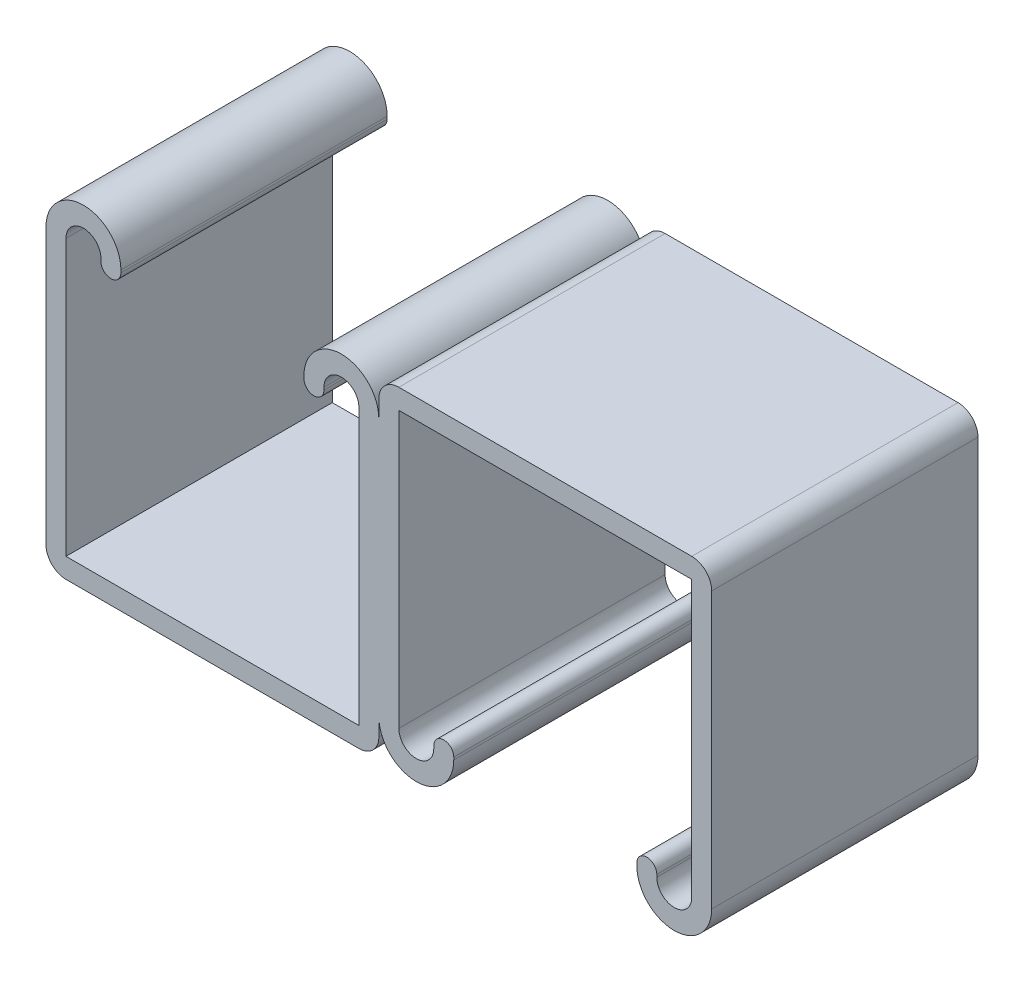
from build123d import *

# Parameters (mm, degrees)
BASE_EXTRUDE_DEPTH = 12.7
CIRPATTERN1_COUNT  = 2


with BuildPart() as part:
    # Sketch1 → Base-Extrude (new, symmetric)
    with BuildSketch(Plane.XY):
        with BuildLine():
            Line((-31.75, 12.303125), (-31.75, -13.97))
            ThreePointArc((-31.75, -13.97), (-31.192038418, -15.317038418), (-29.845, -15.875))
            Line((-29.845, -15.875), (-1.905, -15.875))
            ThreePointArc((-1.905, -15.875), (-0.557961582, -15.317038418), (0, -13.97))
            Line((0, -13.97), (0, 12.303125))
            ThreePointArc((0, 12.303125), (-3.571875, 15.875), (-7.14375, 12.303125))
            Line((-7.14375, 12.303125), (-7.14375, 12.065))
            ThreePointArc((-7.14375, 12.065), (-6.19125, 11.1125), (-5.23875, 12.065))
            Line((-5.23875, 12.065), (-5.23875, 12.303125))
            ThreePointArc((-5.23875, 12.303125), (-3.571875, 13.97), (-1.905, 12.303125))
            Line((-1.905, 12.303125), (-1.905, -13.97))
            Line((-1.905, -13.97), (-29.845, -13.97))
            Line((-29.845, -13.97), (-29.845, 12.303125))
            ThreePointArc((-29.845, 12.303125), (-28.178125, 13.97), (-26.51125, 12.303125))
            Line((-26.51125, 12.303125), (-26.51125, 12.065))
            ThreePointArc((-26.51125, 12.065), (-25.55875, 11.1125), (-24.60625, 12.065))
            Line((-24.60625, 12.065), (-24.60625, 12.303125))
            ThreePointArc((-24.60625, 12.303125), (-28.178125, 15.875), (-31.75, 12.303125))
        make_face()
    base_extrude = extrude(amount=BASE_EXTRUDE_DEPTH, both=True)

    # CirPattern1: Base-Extrude ×2 about axis
    cirpattern1_axis = Axis((0, 0, 0), (0, 0, 1))
    for i in range(1, CIRPATTERN1_COUNT):
        add(base_extrude.rotate(cirpattern1_axis, i * 360 / CIRPATTERN1_COUNT))


solid = part.part
